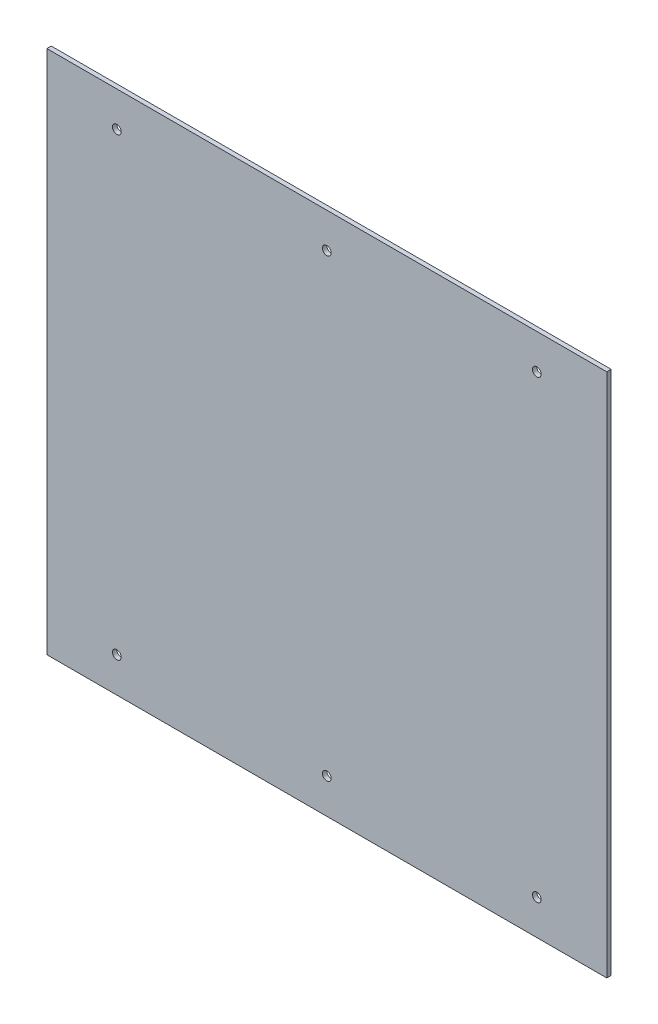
from build123d import *

# Parameters (mm, degrees)
SKETCH_1_W      = 203.2
SKETCH_1_H      = 190.5
SKETCH_1_R      = 1.5875
EXTRUDE_2_DEPTH = 1.5875


with BuildPart() as part:
    # Sketch 1 → Extrude 2 (new body)
    with BuildSketch(Plane.XY):
        with Locations((0, -6.35)):
            Rectangle(SKETCH_1_W, SKETCH_1_H)
        with Locations((76.2, -88.9)):
            Circle(SKETCH_1_R, mode=Mode.SUBTRACT)
        with Locations((0, -88.9)):
            Circle(SKETCH_1_R, mode=Mode.SUBTRACT)
        with Locations((-76.2, -88.9)):
            Circle(SKETCH_1_R, mode=Mode.SUBTRACT)
        with Locations((-76.2, 76.2)):
            Circle(SKETCH_1_R, mode=Mode.SUBTRACT)
        with Locations((0, 76.2)):
            Circle(SKETCH_1_R, mode=Mode.SUBTRACT)
        with Locations((76.2, 76.2)):
            Circle(SKETCH_1_R, mode=Mode.SUBTRACT)
    extrude(amount=EXTRUDE_2_DEPTH)


solid = part.part
